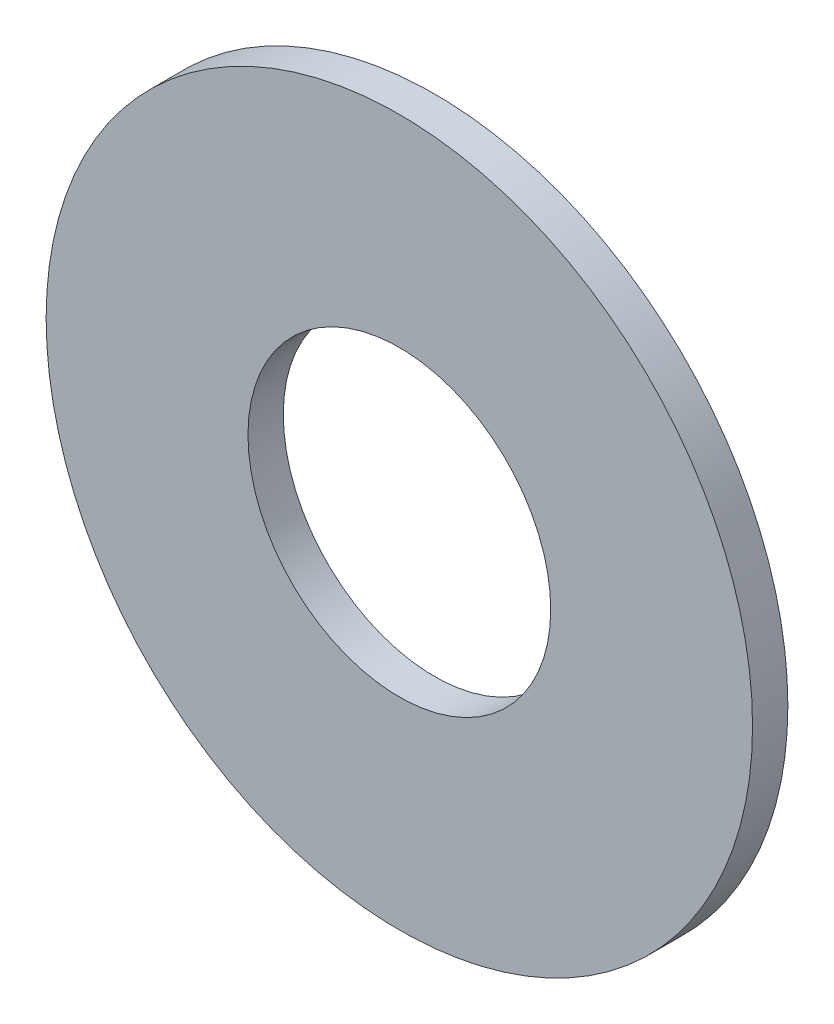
ISO-10303-21;
HEADER;
FILE_DESCRIPTION(('STEP AP214'),'2;1');
FILE_NAME('part.step','',(''),(''),'','','');
FILE_SCHEMA(('AUTOMOTIVE_DESIGN { 1 0 10303 214 1 1 1 1 }'));
ENDSEC;
DATA;
#1=APPLICATION_CONTEXT('core data for automotive mechanical design processes');
#2=APPLICATION_PROTOCOL_DEFINITION('international standard','automotive_design',2000,#1);
#3=PRODUCT_CONTEXT('',#1,'mechanical');
#4=PRODUCT('Part','Part','',(#3));
#5=PRODUCT_RELATED_PRODUCT_CATEGORY('part','',(#4));
#6=PRODUCT_DEFINITION_FORMATION('','',#4);
#7=PRODUCT_DEFINITION_CONTEXT('part definition',#1,'design');
#8=PRODUCT_DEFINITION('design','',#6,#7);
#9=PRODUCT_DEFINITION_SHAPE('','',#8);
#10=(LENGTH_UNIT() NAMED_UNIT(*) SI_UNIT(.MILLI.,.METRE.));
#11=(NAMED_UNIT(*) PLANE_ANGLE_UNIT() SI_UNIT($,.RADIAN.));
#12=(NAMED_UNIT(*) SI_UNIT($,.STERADIAN.) SOLID_ANGLE_UNIT());
#13=UNCERTAINTY_MEASURE_WITH_UNIT(LENGTH_MEASURE(1.E-05),#10,'distance_accuracy_value','');
#14=(GEOMETRIC_REPRESENTATION_CONTEXT(3) GLOBAL_UNCERTAINTY_ASSIGNED_CONTEXT((#13)) GLOBAL_UNIT_ASSIGNED_CONTEXT((#10,
#11,#12)) REPRESENTATION_CONTEXT('',''));
#15=CARTESIAN_POINT('',(0.,0.,0.));
#16=DIRECTION('',(0.,0.,1.));
#17=DIRECTION('',(1.,0.,0.));
#18=AXIS2_PLACEMENT_3D('',#15,#16,#17);
#19=CARTESIAN_POINT('',(45.,0.,1.4));
#20=DIRECTION('',(0.,0.,1.));
#21=DIRECTION('',(1.,0.,0.));
#22=AXIS2_PLACEMENT_3D('',#19,#20,#21);
#23=PLANE('',#22);
#24=CARTESIAN_POINT('',(45.,0.,1.4));
#25=DIRECTION('',(0.,0.,1.));
#26=DIRECTION('',(1.,0.,0.));
#27=AXIS2_PLACEMENT_3D('',#24,#25,#26);
#28=CIRCLE('',#27,14.);
#29=CARTESIAN_POINT('',(59.,0.,1.4));
#30=VERTEX_POINT('',#29);
#31=EDGE_CURVE('E10',#30,#30,#28,.T.);
#32=ORIENTED_EDGE('',*,*,#31,.T.);
#33=EDGE_LOOP('',(#32));
#34=FACE_BOUND('',#33,.T.);
#35=CARTESIAN_POINT('',(45.,0.,1.4));
#36=DIRECTION('',(0.,0.,1.));
#37=DIRECTION('',(1.,0.,0.));
#38=AXIS2_PLACEMENT_3D('',#35,#36,#37);
#39=CIRCLE('',#38,6.);
#40=CARTESIAN_POINT('',(51.,0.,1.4));
#41=VERTEX_POINT('',#40);
#42=EDGE_CURVE('E40',#41,#41,#39,.T.);
#43=ORIENTED_EDGE('',*,*,#42,.F.);
#44=EDGE_LOOP('',(#43));
#45=FACE_BOUND('',#44,.T.);
#46=ADVANCED_FACE('F29',(#34,#45),#23,.T.);
#47=CARTESIAN_POINT('',(45.,0.,0.));
#48=DIRECTION('',(0.,0.,1.));
#49=DIRECTION('',(1.,0.,0.));
#50=AXIS2_PLACEMENT_3D('',#47,#48,#49);
#51=PLANE('',#50);
#52=CARTESIAN_POINT('',(45.,0.,0.));
#53=DIRECTION('',(0.,0.,1.));
#54=DIRECTION('',(1.,0.,0.));
#55=AXIS2_PLACEMENT_3D('',#52,#53,#54);
#56=CIRCLE('',#55,14.);
#57=CARTESIAN_POINT('',(59.,0.,0.));
#58=VERTEX_POINT('',#57);
#59=EDGE_CURVE('E36',#58,#58,#56,.T.);
#60=ORIENTED_EDGE('',*,*,#59,.F.);
#61=EDGE_LOOP('',(#60));
#62=FACE_BOUND('',#61,.T.);
#63=CARTESIAN_POINT('',(45.,0.,0.));
#64=DIRECTION('',(0.,0.,1.));
#65=DIRECTION('',(1.,0.,0.));
#66=AXIS2_PLACEMENT_3D('',#63,#64,#65);
#67=CIRCLE('',#66,6.);
#68=CARTESIAN_POINT('',(51.,0.,0.));
#69=VERTEX_POINT('',#68);
#70=EDGE_CURVE('E44',#69,#69,#67,.T.);
#71=ORIENTED_EDGE('',*,*,#70,.T.);
#72=EDGE_LOOP('',(#71));
#73=FACE_BOUND('',#72,.T.);
#74=ADVANCED_FACE('F50',(#62,#73),#51,.F.);
#75=CARTESIAN_POINT('',(45.,0.,1.4));
#76=DIRECTION('',(0.,0.,-1.));
#77=DIRECTION('',(-1.,0.,0.));
#78=AXIS2_PLACEMENT_3D('',#75,#76,#77);
#79=CYLINDRICAL_SURFACE('',#78,14.);
#80=ORIENTED_EDGE('',*,*,#31,.F.);
#81=EDGE_LOOP('',(#80));
#82=FACE_BOUND('',#81,.T.);
#83=ORIENTED_EDGE('',*,*,#59,.T.);
#84=EDGE_LOOP('',(#83));
#85=FACE_BOUND('',#84,.T.);
#86=ADVANCED_FACE('F31',(#82,#85),#79,.T.);
#87=CARTESIAN_POINT('',(45.,0.,1.4));
#88=DIRECTION('',(0.,0.,-1.));
#89=DIRECTION('',(-1.,0.,0.));
#90=AXIS2_PLACEMENT_3D('',#87,#88,#89);
#91=CYLINDRICAL_SURFACE('',#90,6.);
#92=ORIENTED_EDGE('',*,*,#42,.T.);
#93=EDGE_LOOP('',(#92));
#94=FACE_BOUND('',#93,.T.);
#95=ORIENTED_EDGE('',*,*,#70,.F.);
#96=EDGE_LOOP('',(#95));
#97=FACE_BOUND('',#96,.T.);
#98=ADVANCED_FACE('F52',(#94,#97),#91,.F.);
#99=CLOSED_SHELL('',(#46,#74,#86,#98));
#100=MANIFOLD_SOLID_BREP('B2',#99);
#101=ADVANCED_BREP_SHAPE_REPRESENTATION('',(#18,#100),#14);
#102=SHAPE_DEFINITION_REPRESENTATION(#9,#101);
ENDSEC;
END-ISO-10303-21;
